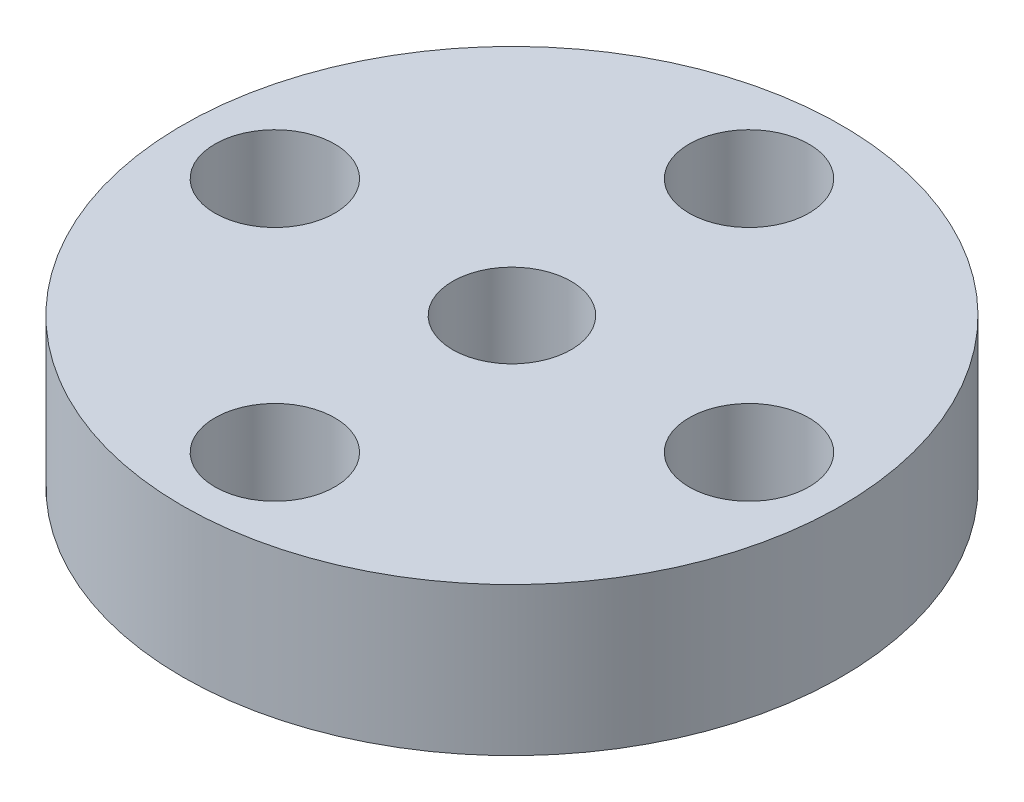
ISO-10303-21;
HEADER;
FILE_DESCRIPTION(('STEP AP214'),'2;1');
FILE_NAME('part.step','',(''),(''),'','','');
FILE_SCHEMA(('AUTOMOTIVE_DESIGN { 1 0 10303 214 1 1 1 1 }'));
ENDSEC;
DATA;
#1=APPLICATION_CONTEXT('core data for automotive mechanical design processes');
#2=APPLICATION_PROTOCOL_DEFINITION('international standard','automotive_design',2000,#1);
#3=PRODUCT_CONTEXT('',#1,'mechanical');
#4=PRODUCT('Part','Part','',(#3));
#5=PRODUCT_RELATED_PRODUCT_CATEGORY('part','',(#4));
#6=PRODUCT_DEFINITION_FORMATION('','',#4);
#7=PRODUCT_DEFINITION_CONTEXT('part definition',#1,'design');
#8=PRODUCT_DEFINITION('design','',#6,#7);
#9=PRODUCT_DEFINITION_SHAPE('','',#8);
#10=(LENGTH_UNIT() NAMED_UNIT(*) SI_UNIT(.MILLI.,.METRE.));
#11=(NAMED_UNIT(*) PLANE_ANGLE_UNIT() SI_UNIT($,.RADIAN.));
#12=(NAMED_UNIT(*) SI_UNIT($,.STERADIAN.) SOLID_ANGLE_UNIT());
#13=UNCERTAINTY_MEASURE_WITH_UNIT(LENGTH_MEASURE(1.E-05),#10,'distance_accuracy_value','');
#14=(GEOMETRIC_REPRESENTATION_CONTEXT(3) GLOBAL_UNCERTAINTY_ASSIGNED_CONTEXT((#13)) GLOBAL_UNIT_ASSIGNED_CONTEXT((#10,
#11,#12)) REPRESENTATION_CONTEXT('',''));
#15=CARTESIAN_POINT('',(0.,0.,0.));
#16=DIRECTION('',(0.,0.,1.));
#17=DIRECTION('',(1.,0.,0.));
#18=AXIS2_PLACEMENT_3D('',#15,#16,#17);
#19=CARTESIAN_POINT('',(-25.9966897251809,5.,-13.7629533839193));
#20=DIRECTION('',(0.,1.,0.));
#21=DIRECTION('',(0.,0.,1.));
#22=AXIS2_PLACEMENT_3D('',#19,#20,#21);
#23=PLANE('',#22);
#24=CARTESIAN_POINT('',(-25.9966897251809,5.,-21.7629533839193));
#25=DIRECTION('',(0.,1.,0.));
#26=DIRECTION('',(0.,0.,1.));
#27=AXIS2_PLACEMENT_3D('',#24,#25,#26);
#28=CIRCLE('',#27,2.02202937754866);
#29=CARTESIAN_POINT('',(-25.9966897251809,5.,-19.7409240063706));
#30=VERTEX_POINT('',#29);
#31=EDGE_CURVE('E59',#30,#30,#28,.T.);
#32=ORIENTED_EDGE('',*,*,#31,.F.);
#33=EDGE_LOOP('',(#32));
#34=FACE_BOUND('',#33,.T.);
#35=CARTESIAN_POINT('',(-25.9966897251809,5.,-13.7629533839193));
#36=DIRECTION('',(0.,1.,0.));
#37=DIRECTION('',(0.,0.,1.));
#38=AXIS2_PLACEMENT_3D('',#35,#36,#37);
#39=CIRCLE('',#38,2.);
#40=CARTESIAN_POINT('',(-25.9966897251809,5.,-11.7629533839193));
#41=VERTEX_POINT('',#40);
#42=EDGE_CURVE('E47',#41,#41,#39,.T.);
#43=ORIENTED_EDGE('',*,*,#42,.F.);
#44=EDGE_LOOP('',(#43));
#45=FACE_BOUND('',#44,.T.);
#46=CARTESIAN_POINT('',(-25.9966897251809,5.,-13.7629533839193));
#47=DIRECTION('',(0.,1.,0.));
#48=DIRECTION('',(0.,0.,1.));
#49=AXIS2_PLACEMENT_3D('',#46,#47,#48);
#50=CIRCLE('',#49,11.1211615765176);
#51=CARTESIAN_POINT('',(-25.9966897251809,5.,-2.64179180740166));
#52=VERTEX_POINT('',#51);
#53=EDGE_CURVE('E10',#52,#52,#50,.T.);
#54=ORIENTED_EDGE('',*,*,#53,.T.);
#55=EDGE_LOOP('',(#54));
#56=FACE_BOUND('',#55,.T.);
#57=CARTESIAN_POINT('',(-33.9966897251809,5.,-13.7629533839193));
#58=DIRECTION('',(0.,1.,0.));
#59=DIRECTION('',(0.,0.,1.));
#60=AXIS2_PLACEMENT_3D('',#57,#58,#59);
#61=CIRCLE('',#60,2.02202937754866);
#62=CARTESIAN_POINT('',(-33.9966897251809,5.,-11.7409240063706));
#63=VERTEX_POINT('',#62);
#64=EDGE_CURVE('E42',#63,#63,#61,.T.);
#65=ORIENTED_EDGE('',*,*,#64,.F.);
#66=EDGE_LOOP('',(#65));
#67=FACE_BOUND('',#66,.T.);
#68=CARTESIAN_POINT('',(-17.9966897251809,5.,-13.7629533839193));
#69=DIRECTION('',(0.,1.,0.));
#70=DIRECTION('',(0.,0.,1.));
#71=AXIS2_PLACEMENT_3D('',#68,#69,#70);
#72=CIRCLE('',#71,2.02202937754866);
#73=CARTESIAN_POINT('',(-17.9966897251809,5.,-11.7409240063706));
#74=VERTEX_POINT('',#73);
#75=EDGE_CURVE('E53',#74,#74,#72,.T.);
#76=ORIENTED_EDGE('',*,*,#75,.F.);
#77=EDGE_LOOP('',(#76));
#78=FACE_BOUND('',#77,.T.);
#79=CARTESIAN_POINT('',(-25.9966897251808,5.,-5.7629533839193));
#80=DIRECTION('',(0.,1.,0.));
#81=DIRECTION('',(0.,0.,1.));
#82=AXIS2_PLACEMENT_3D('',#79,#80,#81);
#83=CIRCLE('',#82,2.02202937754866);
#84=CARTESIAN_POINT('',(-25.9966897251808,5.,-3.74092400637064));
#85=VERTEX_POINT('',#84);
#86=EDGE_CURVE('E65',#85,#85,#83,.T.);
#87=ORIENTED_EDGE('',*,*,#86,.F.);
#88=EDGE_LOOP('',(#87));
#89=FACE_BOUND('',#88,.T.);
#90=ADVANCED_FACE('F31',(#34,#45,#56,#67,#78,#89),#23,.T.);
#91=CARTESIAN_POINT('',(-25.9966897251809,0.,-13.7629533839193));
#92=DIRECTION('',(0.,1.,0.));
#93=DIRECTION('',(0.,0.,1.));
#94=AXIS2_PLACEMENT_3D('',#91,#92,#93);
#95=PLANE('',#94);
#96=CARTESIAN_POINT('',(-25.9966897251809,0.,-13.7629533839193));
#97=DIRECTION('',(0.,1.,0.));
#98=DIRECTION('',(0.,0.,1.));
#99=AXIS2_PLACEMENT_3D('',#96,#97,#98);
#100=CIRCLE('',#99,11.1211615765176);
#101=CARTESIAN_POINT('',(-25.9966897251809,0.,-2.64179180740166));
#102=VERTEX_POINT('',#101);
#103=EDGE_CURVE('E35',#102,#102,#100,.T.);
#104=ORIENTED_EDGE('',*,*,#103,.F.);
#105=EDGE_LOOP('',(#104));
#106=FACE_BOUND('',#105,.T.);
#107=CARTESIAN_POINT('',(-33.9966897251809,0.,-13.7629533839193));
#108=DIRECTION('',(0.,1.,0.));
#109=DIRECTION('',(0.,0.,1.));
#110=AXIS2_PLACEMENT_3D('',#107,#108,#109);
#111=CIRCLE('',#110,2.02202937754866);
#112=CARTESIAN_POINT('',(-33.9966897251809,0.,-11.7409240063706));
#113=VERTEX_POINT('',#112);
#114=EDGE_CURVE('E44',#113,#113,#111,.T.);
#115=ORIENTED_EDGE('',*,*,#114,.T.);
#116=EDGE_LOOP('',(#115));
#117=FACE_BOUND('',#116,.T.);
#118=CARTESIAN_POINT('',(-25.9966897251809,0.,-13.7629533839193));
#119=DIRECTION('',(0.,1.,0.));
#120=DIRECTION('',(0.,0.,1.));
#121=AXIS2_PLACEMENT_3D('',#118,#119,#120);
#122=CIRCLE('',#121,2.);
#123=CARTESIAN_POINT('',(-25.9966897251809,0.,-11.7629533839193));
#124=VERTEX_POINT('',#123);
#125=EDGE_CURVE('E50',#124,#124,#122,.T.);
#126=ORIENTED_EDGE('',*,*,#125,.T.);
#127=EDGE_LOOP('',(#126));
#128=FACE_BOUND('',#127,.T.);
#129=CARTESIAN_POINT('',(-17.9966897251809,0.,-13.7629533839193));
#130=DIRECTION('',(0.,1.,0.));
#131=DIRECTION('',(0.,0.,1.));
#132=AXIS2_PLACEMENT_3D('',#129,#130,#131);
#133=CIRCLE('',#132,2.02202937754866);
#134=CARTESIAN_POINT('',(-17.9966897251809,0.,-11.7409240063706));
#135=VERTEX_POINT('',#134);
#136=EDGE_CURVE('E56',#135,#135,#133,.T.);
#137=ORIENTED_EDGE('',*,*,#136,.T.);
#138=EDGE_LOOP('',(#137));
#139=FACE_BOUND('',#138,.T.);
#140=CARTESIAN_POINT('',(-25.9966897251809,0.,-21.7629533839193));
#141=DIRECTION('',(0.,1.,0.));
#142=DIRECTION('',(0.,0.,1.));
#143=AXIS2_PLACEMENT_3D('',#140,#141,#142);
#144=CIRCLE('',#143,2.02202937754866);
#145=CARTESIAN_POINT('',(-25.9966897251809,0.,-19.7409240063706));
#146=VERTEX_POINT('',#145);
#147=EDGE_CURVE('E62',#146,#146,#144,.T.);
#148=ORIENTED_EDGE('',*,*,#147,.T.);
#149=EDGE_LOOP('',(#148));
#150=FACE_BOUND('',#149,.T.);
#151=CARTESIAN_POINT('',(-25.9966897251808,0.,-5.7629533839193));
#152=DIRECTION('',(0.,1.,0.));
#153=DIRECTION('',(0.,0.,1.));
#154=AXIS2_PLACEMENT_3D('',#151,#152,#153);
#155=CIRCLE('',#154,2.02202937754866);
#156=CARTESIAN_POINT('',(-25.9966897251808,0.,-3.74092400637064));
#157=VERTEX_POINT('',#156);
#158=EDGE_CURVE('E68',#157,#157,#155,.T.);
#159=ORIENTED_EDGE('',*,*,#158,.T.);
#160=EDGE_LOOP('',(#159));
#161=FACE_BOUND('',#160,.T.);
#162=ADVANCED_FACE('F78',(#106,#117,#128,#139,#150,#161),#95,.F.);
#163=CARTESIAN_POINT('',(-25.9966897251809,5.,-13.7629533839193));
#164=DIRECTION('',(0.,-1.,0.));
#165=DIRECTION('',(0.,0.,-1.));
#166=AXIS2_PLACEMENT_3D('',#163,#164,#165);
#167=CYLINDRICAL_SURFACE('',#166,11.1211615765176);
#168=ORIENTED_EDGE('',*,*,#53,.F.);
#169=EDGE_LOOP('',(#168));
#170=FACE_BOUND('',#169,.T.);
#171=ORIENTED_EDGE('',*,*,#103,.T.);
#172=EDGE_LOOP('',(#171));
#173=FACE_BOUND('',#172,.T.);
#174=ADVANCED_FACE('F33',(#170,#173),#167,.T.);
#175=CARTESIAN_POINT('',(-33.9966897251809,5.,-13.7629533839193));
#176=DIRECTION('',(0.,-1.,0.));
#177=DIRECTION('',(0.,0.,-1.));
#178=AXIS2_PLACEMENT_3D('',#175,#176,#177);
#179=CYLINDRICAL_SURFACE('',#178,2.02202937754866);
#180=ORIENTED_EDGE('',*,*,#64,.T.);
#181=EDGE_LOOP('',(#180));
#182=FACE_BOUND('',#181,.T.);
#183=ORIENTED_EDGE('',*,*,#114,.F.);
#184=EDGE_LOOP('',(#183));
#185=FACE_BOUND('',#184,.T.);
#186=ADVANCED_FACE('F88',(#182,#185),#179,.F.);
#187=CARTESIAN_POINT('',(-25.9966897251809,5.,-13.7629533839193));
#188=DIRECTION('',(0.,-1.,0.));
#189=DIRECTION('',(0.,0.,-1.));
#190=AXIS2_PLACEMENT_3D('',#187,#188,#189);
#191=CYLINDRICAL_SURFACE('',#190,2.);
#192=ORIENTED_EDGE('',*,*,#42,.T.);
#193=EDGE_LOOP('',(#192));
#194=FACE_BOUND('',#193,.T.);
#195=ORIENTED_EDGE('',*,*,#125,.F.);
#196=EDGE_LOOP('',(#195));
#197=FACE_BOUND('',#196,.T.);
#198=ADVANCED_FACE('F91',(#194,#197),#191,.F.);
#199=CARTESIAN_POINT('',(-17.9966897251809,5.,-13.7629533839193));
#200=DIRECTION('',(0.,-1.,0.));
#201=DIRECTION('',(0.,0.,-1.));
#202=AXIS2_PLACEMENT_3D('',#199,#200,#201);
#203=CYLINDRICAL_SURFACE('',#202,2.02202937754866);
#204=ORIENTED_EDGE('',*,*,#75,.T.);
#205=EDGE_LOOP('',(#204));
#206=FACE_BOUND('',#205,.T.);
#207=ORIENTED_EDGE('',*,*,#136,.F.);
#208=EDGE_LOOP('',(#207));
#209=FACE_BOUND('',#208,.T.);
#210=ADVANCED_FACE('F95',(#206,#209),#203,.F.);
#211=CARTESIAN_POINT('',(-25.9966897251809,5.,-21.7629533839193));
#212=DIRECTION('',(0.,-1.,0.));
#213=DIRECTION('',(0.,0.,-1.));
#214=AXIS2_PLACEMENT_3D('',#211,#212,#213);
#215=CYLINDRICAL_SURFACE('',#214,2.02202937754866);
#216=ORIENTED_EDGE('',*,*,#31,.T.);
#217=EDGE_LOOP('',(#216));
#218=FACE_BOUND('',#217,.T.);
#219=ORIENTED_EDGE('',*,*,#147,.F.);
#220=EDGE_LOOP('',(#219));
#221=FACE_BOUND('',#220,.T.);
#222=ADVANCED_FACE('F99',(#218,#221),#215,.F.);
#223=CARTESIAN_POINT('',(-25.9966897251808,5.,-5.7629533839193));
#224=DIRECTION('',(0.,-1.,0.));
#225=DIRECTION('',(0.,0.,-1.));
#226=AXIS2_PLACEMENT_3D('',#223,#224,#225);
#227=CYLINDRICAL_SURFACE('',#226,2.02202937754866);
#228=ORIENTED_EDGE('',*,*,#86,.T.);
#229=EDGE_LOOP('',(#228));
#230=FACE_BOUND('',#229,.T.);
#231=ORIENTED_EDGE('',*,*,#158,.F.);
#232=EDGE_LOOP('',(#231));
#233=FACE_BOUND('',#232,.T.);
#234=ADVANCED_FACE('F74',(#230,#233),#227,.F.);
#235=CLOSED_SHELL('',(#90,#162,#174,#186,#198,#210,#222,#234));
#236=MANIFOLD_SOLID_BREP('B2',#235);
#237=ADVANCED_BREP_SHAPE_REPRESENTATION('',(#18,#236),#14);
#238=SHAPE_DEFINITION_REPRESENTATION(#9,#237);
ENDSEC;
END-ISO-10303-21;
